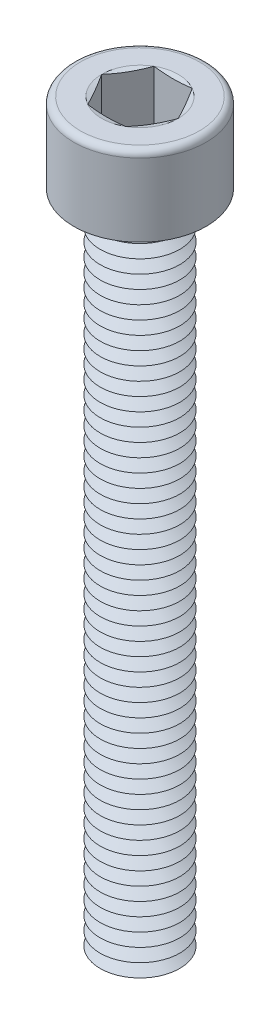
from build123d import *

# Parameters (mm, degrees)
SKETCH1_R       = 3
EXTRUDE1_DEPTH  = 50
SKETCH2_R       = 5
EXTRUDE2_DEPTH  = 6
EXTRUDE3_DEPTH  = 5
FILLET1_R       = 0.5
LPATTERN1_COUNT = 50
LPATTERN1_PITCH = 1


with BuildPart() as part:
    # Sketch1 → Extrude1 (new body)
    with BuildSketch(Plane(origin=(0, 0, 0), x_dir=(1, 0, 0), z_dir=(0, 1, 0))):
        with Locations(Location((0, 0, 0), (0, 0, 270))):
            Circle(SKETCH1_R)
    extrude(amount=EXTRUDE1_DEPTH)

    # Sketch2 → Extrude2 (add)
    with BuildSketch(Plane(origin=(0, 50, 0), x_dir=(1, 0, 0), z_dir=(0, 1, 0))):
        with Locations(Location((0, 0, 0), (0, 0, 270))):
            Circle(SKETCH2_R)
    extrude(amount=EXTRUDE2_DEPTH)

    # Sketch3 → Extrude3 (cut)
    with BuildSketch(Plane(origin=(0, 56, 0), x_dir=(1, 0, 0), z_dir=(0, 1, 0))):
        Polygon((1.443375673, 2.5), (-1.443375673, 2.5), (-2.886751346, 0), (-1.443375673, -2.5), (1.443375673, -2.5), (2.886751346, 0), align=None)
    extrude(amount=-EXTRUDE3_DEPTH, mode=Mode.SUBTRACT)

    # Fillet1
    fillet1_edges = [part.edges().sort_by_distance(p)[0] for p in [
        (0, 56, -5),
    ]]
    fillet(fillet1_edges, radius=FILLET1_R)

    # Sketch4 → Cut-Revolve1 (revolve, cut)
    with BuildSketch(Plane(origin=(0, 0, 0), x_dir=(0, 0, -1), z_dir=(1, 0, 0))):
        Polygon((-2.5, 51), (0, 51), (0, 49.556624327), align=None)
    revolve(axis=Axis((0, 51, 0), (0, -1, 0)), mode=Mode.SUBTRACT)

    # Sketch5 → Cut-Revolve2 (revolve, cut)
    with BuildSketch(Plane.XY, mode=Mode.PRIVATE) as cut_revolve2_sk:
        Polygon((-3, 0.5), (-3, -0.5), (-2.133974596, 0), align=None)
    cut_revolve2 = revolve(cut_revolve2_sk.sketch.rotate(Axis((0, 50, 0), (0, -1, 0)), 270), axis=Axis((0, 50, 0), (0, -1, 0)), mode=Mode.SUBTRACT)

    # LPattern1: Cut-Revolve2 ×50
    with Locations(*[(0, i * LPATTERN1_PITCH, 0) for i in range(1, LPATTERN1_COUNT)]):
        add(cut_revolve2, mode=Mode.SUBTRACT)

    # Extrude4 cone 1 section (on through the dimple's axis) → Extrude4 (revolve, cut)
    with BuildSketch(Plane(origin=(0, 56, 0), x_dir=(0, 0, 1), z_dir=(1, 0, 0))):
        Polygon((0, 0), (2.886751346, 0), (0, 0.773502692), align=None)
    revolve(axis=Axis((0, 56, 0), (0, -1, 0)), mode=Mode.SUBTRACT)


solid = part.part
